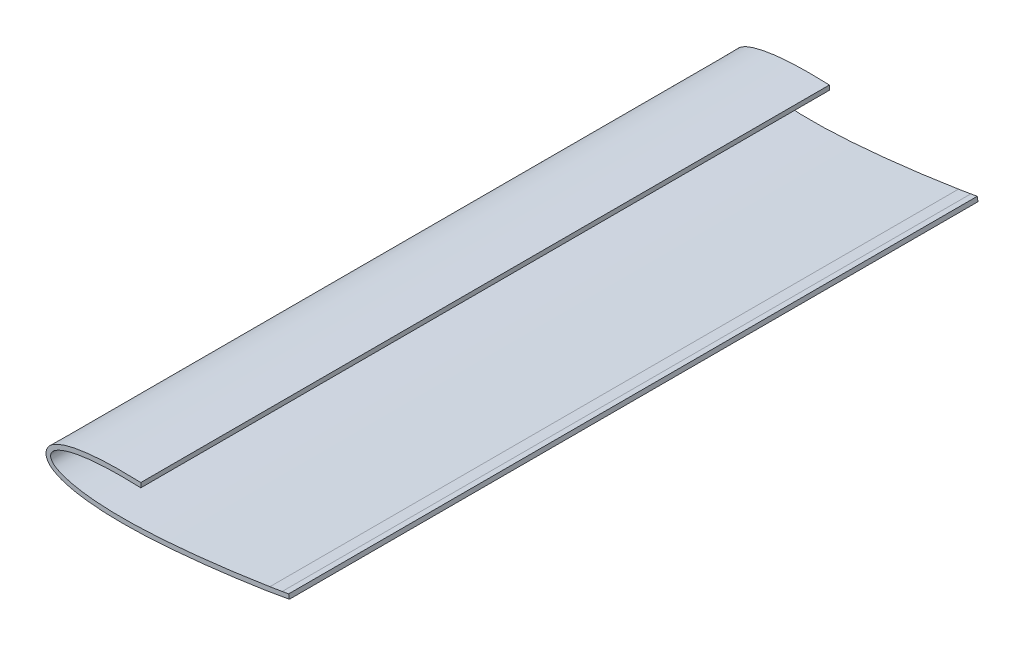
from build123d import *

# Parameters (mm, degrees)
SALIENTE_EXTRUIR1_DEPTH = 300


with BuildPart() as part:
    # Croquis1 → Saliente-Extruir1 (new body)
    with BuildSketch(Plane.XY):
        with BuildLine():
            Line((-12.545664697, 8.659327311), (-12.545664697, 6.657847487))
            add(Edge.make_bspline(
                [(-12.545664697, 6.657847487), (-15.287738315, 6.766798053), (-19.757568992, 6.870917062), (-25.955866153, 6.794229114), (-31.139208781, 6.54463721), (-36.329951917, 6.058320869), (-40.651745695, 5.373739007), (-44.103601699, 4.557585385), (-46.724742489, 3.738082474), (-48.92869557, 2.742227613), (-50.907614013, 1.423285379), (-52.444357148, -0.893371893), (-50.913471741, -3.213904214), (-48.937891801, -4.537841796), (-46.736461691, -5.539261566), (-44.117399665, -6.365383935), (-40.667616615, -7.190255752), (-36.347566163, -7.885754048), (-31.158068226, -8.385182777), (-25.975372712, -8.647869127), (-19.068610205, -8.750775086), (-10.431156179, -8.522570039), (-0.074221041, -7.85637844), (10.281422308, -6.913289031), (20.63722297, -5.756491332), (30.994252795, -4.420911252), (38.676673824, -3.303257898), (42.907813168, -2.642571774), (43.691858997, -2.518311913)],
                knots=[0.304211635, 0.304211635, 0.304211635, 0.304211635, 0.342903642, 0.367241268, 0.391607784, 0.416059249, 0.440726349, 0.453242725, 0.466028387, 0.479472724, 0.486972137, 0.5, 0.513027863, 0.520527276, 0.533971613, 0.546757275, 0.559273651, 0.583940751, 0.608392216, 0.632758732, 0.657096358, 0.7057811, 0.75454952, 0.803421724, 0.852397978, 0.901477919, 0.95067003, 0.961863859, 0.961863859, 0.961863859, 0.961863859], degree=3))
            Line((43.691858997, -2.518311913), (49.063705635, -1.620543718))
            add(Edge.make_bspline(
                [(49.063705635, -1.620543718), (49.995519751, -1.462017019), (50.927044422, -1.30175657), (51.858569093, -1.141496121)],
                knots=[0.986199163, 0.986199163, 0.986199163, 0.986199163, 1, 1, 1, 1], degree=3))
            Line((51.858569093, -1.141496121), (52.188306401, -3.025249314))
            Line((52.188306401, -3.025249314), (42.051242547, -4.799668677))
            add(Edge.make_bspline(
                [(-12.545664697, 8.659327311), (-14.200813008, 8.72447684), (-17.985890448, 8.836216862), (-23.911730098, 8.853267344), (-29.26124636, 8.659426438), (-33.546647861, 8.333439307), (-36.7638353, 7.984849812), (-39.986334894, 7.506408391), (-42.669669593, 6.965374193), (-44.811837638, 6.416388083), (-46.424217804, 5.927120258), (-48.037729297, 5.332125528), (-49.386793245, 4.70973377), (-50.420301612, 4.132797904), (-51.237569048, 3.605566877), (-52.079586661, 2.901408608), (-52.851310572, 2.021092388), (-53.494349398, 0.946512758), (-53.835452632, -0.156378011), (-53.862311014, -1.184697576), (-53.705035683, -2.140335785), (-53.277966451, -3.162882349), (-52.581099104, -4.158587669), (-51.775779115, -4.978168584), (-50.933387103, -5.612864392), (-49.883488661, -6.251076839), (-48.561591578, -6.913002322), (-46.943262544, -7.555319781), (-45.331411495, -8.078455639), (-43.190778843, -8.660783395), (-40.509657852, -9.234346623), (-37.287781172, -9.744936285), (-34.071367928, -10.119649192), (-30.857044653, -10.387065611), (-26.57576411, -10.626798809), (-21.233617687, -10.736853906), (-14.842287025, -10.649417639), (-8.467413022, -10.386949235), (-2.110000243, -9.986756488), (6.345321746, -9.305218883), (16.882822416, -8.225596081), (29.486391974, -6.657242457), (37.867533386, -5.447568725), (42.051242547, -4.799668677)],
                knots=[0.304581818, 0.304581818, 0.304581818, 0.304581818, 0.327750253, 0.357505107, 0.387259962, 0.402137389, 0.417014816, 0.431892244, 0.446769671, 0.454208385, 0.461647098, 0.469085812, 0.476524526, 0.480243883, 0.483963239, 0.487682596, 0.491401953, 0.49512131, 0.498840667, 0.500700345, 0.502560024, 0.50627938, 0.509998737, 0.513718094, 0.517437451, 0.521156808, 0.528595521, 0.536034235, 0.543472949, 0.550911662, 0.56578909, 0.580666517, 0.595543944, 0.610421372, 0.625298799, 0.655053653, 0.684808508, 0.714563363, 0.744318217, 0.774073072, 0.833582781, 0.893092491, 0.9526022, 0.9526022, 0.9526022, 0.9526022], degree=3))
        make_face()
    extrude(amount=SALIENTE_EXTRUIR1_DEPTH)


solid = part.part
